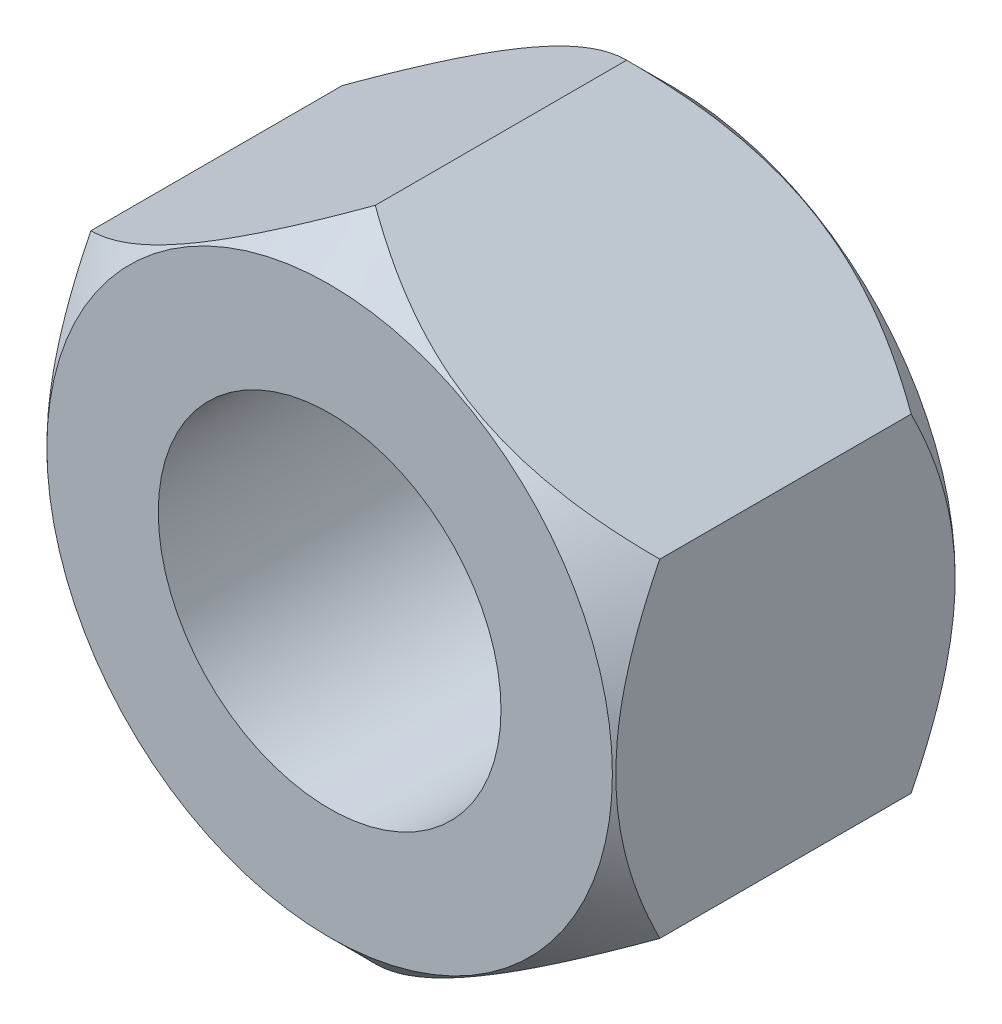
from build123d import *

# Parameters (mm, degrees)
SKETCH_1_R          = 5.75
SKETCH_1_R_2        = 3
EXTRUDE_291_DEPTH   = 6
CHAMFER_1_SIZE      = 0.8
CHAMFER_2_SIZE      = 0.8
SKETCH_2_R          = 6.343675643
CUT_EXTRUDE_1_DEPTH = 11.105691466


with BuildPart() as part:
    # Sketch 1 → Extrude 291 (new body)
    with BuildSketch(Plane.XY):
        Circle(SKETCH_1_R)
        Circle(SKETCH_1_R_2, mode=Mode.SUBTRACT)
    extrude(amount=EXTRUDE_291_DEPTH)

    # Chamfer 1
    chamfer_1_edges = [part.edges().sort_by_distance(p)[0] for p in [
        (-5.75, 0, 6),
    ]]
    chamfer(chamfer_1_edges, length=CHAMFER_1_SIZE)

    # Chamfer 2
    chamfer_2_edges = [part.edges().sort_by_distance(p)[0] for p in [
        (-5.75, 0, 0),
    ]]
    chamfer(chamfer_2_edges, length=CHAMFER_2_SIZE)

    # Sketch 2 → Cut-Extrude 1 (cut, through all)
    with BuildSketch(Plane.XY.offset(6)):
        Circle(SKETCH_2_R)
        Polygon((4.979646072, 2.875), (0, 5.75), (-4.979646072, 2.875), (-4.979646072, -2.875), (0, -5.75), (4.979646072, -2.875), align=None, mode=Mode.SUBTRACT)
    extrude(amount=-CUT_EXTRUDE_1_DEPTH, mode=Mode.SUBTRACT)


solid = part.part
